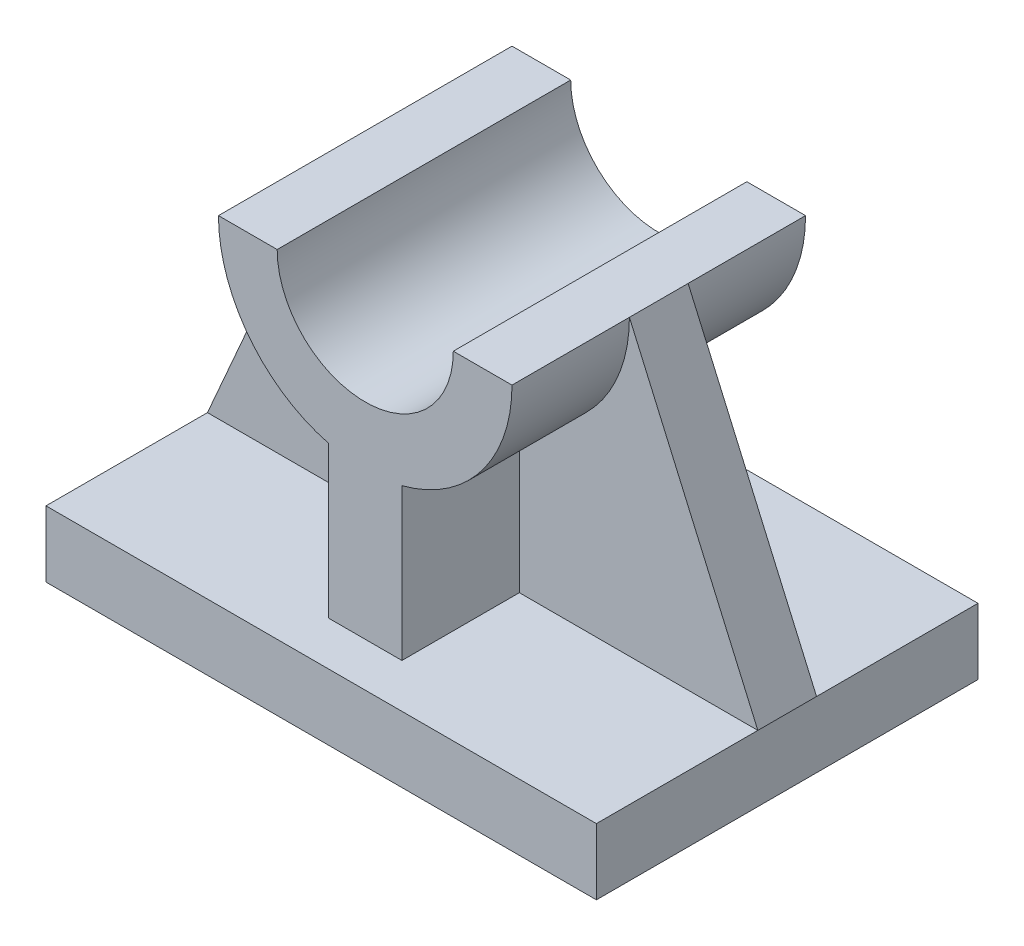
ISO-10303-21;
HEADER;
FILE_DESCRIPTION(('STEP AP214'),'2;1');
FILE_NAME('part.step','',(''),(''),'','','');
FILE_SCHEMA(('AUTOMOTIVE_DESIGN { 1 0 10303 214 1 1 1 1 }'));
ENDSEC;
DATA;
#1=APPLICATION_CONTEXT('core data for automotive mechanical design processes');
#2=APPLICATION_PROTOCOL_DEFINITION('international standard','automotive_design',2000,#1);
#3=PRODUCT_CONTEXT('',#1,'mechanical');
#4=PRODUCT('Part','Part','',(#3));
#5=PRODUCT_RELATED_PRODUCT_CATEGORY('part','',(#4));
#6=PRODUCT_DEFINITION_FORMATION('','',#4);
#7=PRODUCT_DEFINITION_CONTEXT('part definition',#1,'design');
#8=PRODUCT_DEFINITION('design','',#6,#7);
#9=PRODUCT_DEFINITION_SHAPE('','',#8);
#10=(LENGTH_UNIT() NAMED_UNIT(*) SI_UNIT(.MILLI.,.METRE.));
#11=(NAMED_UNIT(*) PLANE_ANGLE_UNIT() SI_UNIT($,.RADIAN.));
#12=(NAMED_UNIT(*) SI_UNIT($,.STERADIAN.) SOLID_ANGLE_UNIT());
#13=UNCERTAINTY_MEASURE_WITH_UNIT(LENGTH_MEASURE(1.E-05),#10,'distance_accuracy_value','');
#14=(GEOMETRIC_REPRESENTATION_CONTEXT(3) GLOBAL_UNCERTAINTY_ASSIGNED_CONTEXT((#13)) GLOBAL_UNIT_ASSIGNED_CONTEXT((#10,
#11,#12)) REPRESENTATION_CONTEXT('',''));
#15=CARTESIAN_POINT('',(0.,0.,0.));
#16=DIRECTION('',(0.,0.,1.));
#17=DIRECTION('',(1.,0.,0.));
#18=AXIS2_PLACEMENT_3D('',#15,#16,#17);
#19=CARTESIAN_POINT('',(0.,0.,26.));
#20=DIRECTION('',(0.,1.,0.));
#21=DIRECTION('',(-1.,0.,0.));
#22=AXIS2_PLACEMENT_3D('',#19,#20,#21);
#23=PLANE('',#22);
#24=DIRECTION('',(0.,0.,-1.));
#25=VECTOR('',#24,1.);
#26=CARTESIAN_POINT('',(-37.5,0.,26.));
#27=LINE('',#26,#25);
#28=CARTESIAN_POINT('',(-37.5,0.,-4.));
#29=VERTEX_POINT('',#28);
#30=CARTESIAN_POINT('',(-37.5,0.,-26.));
#31=VERTEX_POINT('',#30);
#32=EDGE_CURVE('E39',#29,#31,#27,.T.);
#33=ORIENTED_EDGE('',*,*,#32,.F.);
#34=DIRECTION('',(1.,0.,0.));
#35=VECTOR('',#34,1.);
#36=CARTESIAN_POINT('',(0.,0.,-4.));
#37=LINE('',#36,#35);
#38=CARTESIAN_POINT('',(-5.,0.,-4.));
#39=VERTEX_POINT('',#38);
#40=EDGE_CURVE('E287',#29,#39,#37,.T.);
#41=ORIENTED_EDGE('',*,*,#40,.T.);
#42=DIRECTION('',(0.,0.,-1.));
#43=VECTOR('',#42,1.);
#44=CARTESIAN_POINT('',(-5.,0.,20.));
#45=LINE('',#44,#43);
#46=CARTESIAN_POINT('',(-5.,0.,-20.));
#47=VERTEX_POINT('',#46);
#48=EDGE_CURVE('E358',#39,#47,#45,.T.);
#49=ORIENTED_EDGE('',*,*,#48,.T.);
#50=DIRECTION('',(1.,0.,0.));
#51=VECTOR('',#50,1.);
#52=CARTESIAN_POINT('',(0.,0.,-20.));
#53=LINE('',#52,#51);
#54=CARTESIAN_POINT('',(5.,0.,-20.));
#55=VERTEX_POINT('',#54);
#56=EDGE_CURVE('E317',#47,#55,#53,.T.);
#57=ORIENTED_EDGE('',*,*,#56,.T.);
#58=DIRECTION('',(0.,0.,-1.));
#59=VECTOR('',#58,1.);
#60=CARTESIAN_POINT('',(5.,0.,20.));
#61=LINE('',#60,#59);
#62=CARTESIAN_POINT('',(5.,0.,-4.));
#63=VERTEX_POINT('',#62);
#64=EDGE_CURVE('E333',#63,#55,#61,.T.);
#65=ORIENTED_EDGE('',*,*,#64,.F.);
#66=DIRECTION('',(1.,0.,0.));
#67=VECTOR('',#66,1.);
#68=CARTESIAN_POINT('',(0.,0.,-4.));
#69=LINE('',#68,#67);
#70=CARTESIAN_POINT('',(37.5,0.,-4.));
#71=VERTEX_POINT('',#70);
#72=EDGE_CURVE('E306',#63,#71,#69,.T.);
#73=ORIENTED_EDGE('',*,*,#72,.T.);
#74=DIRECTION('',(0.,0.,-1.));
#75=VECTOR('',#74,1.);
#76=CARTESIAN_POINT('',(37.5,0.,26.));
#77=LINE('',#76,#75);
#78=CARTESIAN_POINT('',(37.5,0.,-26.));
#79=VERTEX_POINT('',#78);
#80=EDGE_CURVE('E235',#71,#79,#77,.T.);
#81=ORIENTED_EDGE('',*,*,#80,.T.);
#82=DIRECTION('',(1.,0.,0.));
#83=VECTOR('',#82,1.);
#84=CARTESIAN_POINT('',(0.,0.,-26.));
#85=LINE('',#84,#83);
#86=EDGE_CURVE('E221',#31,#79,#85,.T.);
#87=ORIENTED_EDGE('',*,*,#86,.F.);
#88=EDGE_LOOP('',(#33,#41,#49,#57,#65,#73,#81,#87));
#89=FACE_BOUND('',#88,.T.);
#90=ADVANCED_FACE('F31',(#89),#23,.T.);
#91=CARTESIAN_POINT('',(0.,40.,20.));
#92=DIRECTION('',(0.,0.,-1.));
#93=DIRECTION('',(-1.,0.,0.));
#94=AXIS2_PLACEMENT_3D('',#91,#92,#93);
#95=CYLINDRICAL_SURFACE('',#94,20.);
#96=CARTESIAN_POINT('',(0.,40.,-4.));
#97=DIRECTION('',(0.,0.,1.));
#98=DIRECTION('',(1.,0.,0.));
#99=AXIS2_PLACEMENT_3D('',#96,#97,#98);
#100=CIRCLE('',#99,20.);
#101=CARTESIAN_POINT('',(-20.,40.,-4.));
#102=VERTEX_POINT('',#101);
#103=CARTESIAN_POINT('',(-5.00000000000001,20.6350832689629,-4.));
#104=VERTEX_POINT('',#103);
#105=EDGE_CURVE('E46',#102,#104,#100,.T.);
#106=ORIENTED_EDGE('',*,*,#105,.F.);
#107=DIRECTION('',(0.,0.,-1.));
#108=VECTOR('',#107,1.);
#109=CARTESIAN_POINT('',(-20.,40.,20.));
#110=LINE('',#109,#108);
#111=CARTESIAN_POINT('',(-20.,40.,-20.));
#112=VERTEX_POINT('',#111);
#113=EDGE_CURVE('E199',#102,#112,#110,.T.);
#114=ORIENTED_EDGE('',*,*,#113,.T.);
#115=CARTESIAN_POINT('',(0.,40.,-20.));
#116=DIRECTION('',(0.,0.,1.));
#117=DIRECTION('',(1.,0.,0.));
#118=AXIS2_PLACEMENT_3D('',#115,#116,#117);
#119=CIRCLE('',#118,20.);
#120=CARTESIAN_POINT('',(-5.00000000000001,20.6350832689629,-20.));
#121=VERTEX_POINT('',#120);
#122=EDGE_CURVE('E348',#112,#121,#119,.T.);
#123=ORIENTED_EDGE('',*,*,#122,.T.);
#124=DIRECTION('',(0.,0.,-1.));
#125=VECTOR('',#124,1.);
#126=CARTESIAN_POINT('',(-5.00000000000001,20.6350832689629,20.));
#127=LINE('',#126,#125);
#128=EDGE_CURVE('E359',#104,#121,#127,.T.);
#129=ORIENTED_EDGE('',*,*,#128,.F.);
#130=EDGE_LOOP('',(#106,#114,#123,#129));
#131=FACE_BOUND('',#130,.T.);
#132=ADVANCED_FACE('F373',(#131),#95,.T.);
#133=CARTESIAN_POINT('',(-4.99999999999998,-54.3244896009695,20.));
#134=DIRECTION('',(-1.,0.,0.));
#135=DIRECTION('',(0.,-1.,0.));
#136=AXIS2_PLACEMENT_3D('',#133,#134,#135);
#137=PLANE('',#136);
#138=ORIENTED_EDGE('',*,*,#48,.F.);
#139=DIRECTION('',(0.,1.,0.));
#140=VECTOR('',#139,1.);
#141=CARTESIAN_POINT('',(-4.99999999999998,-54.3244896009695,-4.));
#142=LINE('',#141,#140);
#143=EDGE_CURVE('E181',#39,#104,#142,.T.);
#144=ORIENTED_EDGE('',*,*,#143,.T.);
#145=ORIENTED_EDGE('',*,*,#128,.T.);
#146=DIRECTION('',(0.,1.,0.));
#147=VECTOR('',#146,1.);
#148=CARTESIAN_POINT('',(-4.99999999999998,-54.3244896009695,-20.));
#149=LINE('',#148,#147);
#150=EDGE_CURVE('E351',#47,#121,#149,.T.);
#151=ORIENTED_EDGE('',*,*,#150,.F.);
#152=EDGE_LOOP('',(#138,#144,#145,#151));
#153=FACE_BOUND('',#152,.T.);
#154=ADVANCED_FACE('F370',(#153),#137,.T.);
#155=CARTESIAN_POINT('',(5.,-54.3244896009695,20.));
#156=DIRECTION('',(-1.,0.,0.));
#157=DIRECTION('',(0.,-1.,0.));
#158=AXIS2_PLACEMENT_3D('',#155,#156,#157);
#159=PLANE('',#158);
#160=DIRECTION('',(0.,1.,0.));
#161=VECTOR('',#160,1.);
#162=CARTESIAN_POINT('',(5.,-54.3244896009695,-4.));
#163=LINE('',#162,#161);
#164=CARTESIAN_POINT('',(5.,20.6350832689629,-4.));
#165=VERTEX_POINT('',#164);
#166=EDGE_CURVE('E304',#63,#165,#163,.T.);
#167=ORIENTED_EDGE('',*,*,#166,.F.);
#168=ORIENTED_EDGE('',*,*,#64,.T.);
#169=DIRECTION('',(0.,1.,0.));
#170=VECTOR('',#169,1.);
#171=CARTESIAN_POINT('',(5.,-54.3244896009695,-20.));
#172=LINE('',#171,#170);
#173=CARTESIAN_POINT('',(5.,20.6350832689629,-20.));
#174=VERTEX_POINT('',#173);
#175=EDGE_CURVE('E312',#55,#174,#172,.T.);
#176=ORIENTED_EDGE('',*,*,#175,.T.);
#177=DIRECTION('',(0.,0.,-1.));
#178=VECTOR('',#177,1.);
#179=CARTESIAN_POINT('',(5.,20.6350832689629,20.));
#180=LINE('',#179,#178);
#181=EDGE_CURVE('E217',#165,#174,#180,.T.);
#182=ORIENTED_EDGE('',*,*,#181,.F.);
#183=EDGE_LOOP('',(#167,#168,#176,#182));
#184=FACE_BOUND('',#183,.T.);
#185=ADVANCED_FACE('F389',(#184),#159,.F.);
#186=CARTESIAN_POINT('',(0.,40.,20.));
#187=DIRECTION('',(0.,0.,-1.));
#188=DIRECTION('',(-1.,0.,0.));
#189=AXIS2_PLACEMENT_3D('',#186,#187,#188);
#190=CYLINDRICAL_SURFACE('',#189,20.);
#191=CARTESIAN_POINT('',(0.,40.,-4.));
#192=DIRECTION('',(0.,0.,1.));
#193=DIRECTION('',(1.,0.,0.));
#194=AXIS2_PLACEMENT_3D('',#191,#192,#193);
#195=CIRCLE('',#194,20.);
#196=CARTESIAN_POINT('',(20.,40.,-4.));
#197=VERTEX_POINT('',#196);
#198=EDGE_CURVE('E54',#165,#197,#195,.T.);
#199=ORIENTED_EDGE('',*,*,#198,.F.);
#200=ORIENTED_EDGE('',*,*,#181,.T.);
#201=CARTESIAN_POINT('',(0.,40.,-20.));
#202=DIRECTION('',(0.,0.,1.));
#203=DIRECTION('',(1.,0.,0.));
#204=AXIS2_PLACEMENT_3D('',#201,#202,#203);
#205=CIRCLE('',#204,20.);
#206=CARTESIAN_POINT('',(20.,40.,-20.));
#207=VERTEX_POINT('',#206);
#208=EDGE_CURVE('E336',#174,#207,#205,.T.);
#209=ORIENTED_EDGE('',*,*,#208,.T.);
#210=DIRECTION('',(0.,0.,-1.));
#211=VECTOR('',#210,1.);
#212=CARTESIAN_POINT('',(20.,40.,20.));
#213=LINE('',#212,#211);
#214=EDGE_CURVE('E213',#197,#207,#213,.T.);
#215=ORIENTED_EDGE('',*,*,#214,.F.);
#216=EDGE_LOOP('',(#199,#200,#209,#215));
#217=FACE_BOUND('',#216,.T.);
#218=ADVANCED_FACE('F385',(#217),#190,.T.);
#219=DIRECTION('',(1.,0.,0.));
#220=VECTOR('',#219,1.);
#221=CARTESIAN_POINT('',(0.,0.,4.));
#222=LINE('',#221,#220);
#223=CARTESIAN_POINT('',(-37.5,0.,4.));
#224=VERTEX_POINT('',#223);
#225=CARTESIAN_POINT('',(-5.,0.,4.));
#226=VERTEX_POINT('',#225);
#227=EDGE_CURVE('E190',#224,#226,#222,.T.);
#228=ORIENTED_EDGE('',*,*,#227,.F.);
#229=CARTESIAN_POINT('',(-37.5,0.,26.));
#230=VERTEX_POINT('',#229);
#231=EDGE_CURVE('E11',#230,#224,#27,.T.);
#232=ORIENTED_EDGE('',*,*,#231,.F.);
#233=DIRECTION('',(1.,0.,0.));
#234=VECTOR('',#233,1.);
#235=CARTESIAN_POINT('',(0.,0.,26.));
#236=LINE('',#235,#234);
#237=CARTESIAN_POINT('',(37.5,0.,26.));
#238=VERTEX_POINT('',#237);
#239=EDGE_CURVE('E222',#230,#238,#236,.T.);
#240=ORIENTED_EDGE('',*,*,#239,.T.);
#241=CARTESIAN_POINT('',(37.5,0.,4.));
#242=VERTEX_POINT('',#241);
#243=EDGE_CURVE('E246',#238,#242,#77,.T.);
#244=ORIENTED_EDGE('',*,*,#243,.T.);
#245=DIRECTION('',(1.,0.,0.));
#246=VECTOR('',#245,1.);
#247=CARTESIAN_POINT('',(0.,0.,4.));
#248=LINE('',#247,#246);
#249=CARTESIAN_POINT('',(5.,0.,4.));
#250=VERTEX_POINT('',#249);
#251=EDGE_CURVE('E298',#250,#242,#248,.T.);
#252=ORIENTED_EDGE('',*,*,#251,.F.);
#253=CARTESIAN_POINT('',(5.,0.,20.));
#254=VERTEX_POINT('',#253);
#255=EDGE_CURVE('E356',#254,#250,#61,.T.);
#256=ORIENTED_EDGE('',*,*,#255,.F.);
#257=DIRECTION('',(1.,0.,0.));
#258=VECTOR('',#257,1.);
#259=CARTESIAN_POINT('',(0.,0.,20.));
#260=LINE('',#259,#258);
#261=CARTESIAN_POINT('',(-5.,0.,20.));
#262=VERTEX_POINT('',#261);
#263=EDGE_CURVE('E331',#262,#254,#260,.T.);
#264=ORIENTED_EDGE('',*,*,#263,.F.);
#265=EDGE_CURVE('E280',#262,#226,#45,.T.);
#266=ORIENTED_EDGE('',*,*,#265,.T.);
#267=EDGE_LOOP('',(#228,#232,#240,#244,#252,#256,#264,#266));
#268=FACE_BOUND('',#267,.T.);
#269=ADVANCED_FACE('F33',(#268),#23,.T.);
#270=CARTESIAN_POINT('',(-37.5,-54.3244896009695,26.));
#271=DIRECTION('',(-1.,0.,0.));
#272=DIRECTION('',(0.,0.,1.));
#273=AXIS2_PLACEMENT_3D('',#270,#271,#272);
#274=PLANE('',#273);
#275=DIRECTION('',(0.,1.,0.));
#276=VECTOR('',#275,1.);
#277=CARTESIAN_POINT('',(-37.5,-54.3244896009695,-26.));
#278=LINE('',#277,#276);
#279=CARTESIAN_POINT('',(-37.5,-8.99999999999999,-26.));
#280=VERTEX_POINT('',#279);
#281=EDGE_CURVE('E238',#280,#31,#278,.T.);
#282=ORIENTED_EDGE('',*,*,#281,.F.);
#283=DIRECTION('',(0.,0.,-1.));
#284=VECTOR('',#283,1.);
#285=CARTESIAN_POINT('',(-37.5,-8.99999999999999,26.));
#286=LINE('',#285,#284);
#287=CARTESIAN_POINT('',(-37.5,-8.99999999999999,26.));
#288=VERTEX_POINT('',#287);
#289=EDGE_CURVE('E250',#288,#280,#286,.T.);
#290=ORIENTED_EDGE('',*,*,#289,.F.);
#291=DIRECTION('',(0.,1.,0.));
#292=VECTOR('',#291,1.);
#293=CARTESIAN_POINT('',(-37.5,-54.3244896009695,26.));
#294=LINE('',#293,#292);
#295=EDGE_CURVE('E225',#288,#230,#294,.T.);
#296=ORIENTED_EDGE('',*,*,#295,.T.);
#297=ORIENTED_EDGE('',*,*,#231,.T.);
#298=DIRECTION('',(0.,0.,-1.));
#299=VECTOR('',#298,1.);
#300=CARTESIAN_POINT('',(-37.5,0.,4.));
#301=LINE('',#300,#299);
#302=EDGE_CURVE('E189',#224,#29,#301,.T.);
#303=ORIENTED_EDGE('',*,*,#302,.T.);
#304=ORIENTED_EDGE('',*,*,#32,.T.);
#305=EDGE_LOOP('',(#282,#290,#296,#297,#303,#304));
#306=FACE_BOUND('',#305,.T.);
#307=ADVANCED_FACE('F257',(#306),#274,.T.);
#308=CARTESIAN_POINT('',(0.,-8.99999999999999,26.));
#309=DIRECTION('',(0.,-1.,0.));
#310=DIRECTION('',(1.,0.,0.));
#311=AXIS2_PLACEMENT_3D('',#308,#309,#310);
#312=PLANE('',#311);
#313=DIRECTION('',(-1.,0.,0.));
#314=VECTOR('',#313,1.);
#315=CARTESIAN_POINT('',(0.,-8.99999999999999,-26.));
#316=LINE('',#315,#314);
#317=CARTESIAN_POINT('',(37.5,-8.99999999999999,-26.));
#318=VERTEX_POINT('',#317);
#319=EDGE_CURVE('E241',#318,#280,#316,.T.);
#320=ORIENTED_EDGE('',*,*,#319,.F.);
#321=DIRECTION('',(0.,0.,-1.));
#322=VECTOR('',#321,1.);
#323=CARTESIAN_POINT('',(37.5,-8.99999999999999,26.));
#324=LINE('',#323,#322);
#325=CARTESIAN_POINT('',(37.5,-8.99999999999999,26.));
#326=VERTEX_POINT('',#325);
#327=EDGE_CURVE('E249',#326,#318,#324,.T.);
#328=ORIENTED_EDGE('',*,*,#327,.F.);
#329=DIRECTION('',(-1.,0.,0.));
#330=VECTOR('',#329,1.);
#331=CARTESIAN_POINT('',(0.,-8.99999999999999,26.));
#332=LINE('',#331,#330);
#333=EDGE_CURVE('E229',#326,#288,#332,.T.);
#334=ORIENTED_EDGE('',*,*,#333,.T.);
#335=ORIENTED_EDGE('',*,*,#289,.T.);
#336=EDGE_LOOP('',(#320,#328,#334,#335));
#337=FACE_BOUND('',#336,.T.);
#338=ADVANCED_FACE('F265',(#337),#312,.T.);
#339=CARTESIAN_POINT('',(37.5,-54.3244896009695,26.));
#340=DIRECTION('',(1.,0.,0.));
#341=DIRECTION('',(0.,0.,-1.));
#342=AXIS2_PLACEMENT_3D('',#339,#340,#341);
#343=PLANE('',#342);
#344=DIRECTION('',(0.,-1.,0.));
#345=VECTOR('',#344,1.);
#346=CARTESIAN_POINT('',(37.5,-54.3244896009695,-26.));
#347=LINE('',#346,#345);
#348=EDGE_CURVE('E226',#79,#318,#347,.T.);
#349=ORIENTED_EDGE('',*,*,#348,.F.);
#350=ORIENTED_EDGE('',*,*,#80,.F.);
#351=DIRECTION('',(0.,0.,-1.));
#352=VECTOR('',#351,1.);
#353=CARTESIAN_POINT('',(37.5,0.,4.));
#354=LINE('',#353,#352);
#355=EDGE_CURVE('E275',#242,#71,#354,.T.);
#356=ORIENTED_EDGE('',*,*,#355,.F.);
#357=ORIENTED_EDGE('',*,*,#243,.F.);
#358=DIRECTION('',(0.,-1.,0.));
#359=VECTOR('',#358,1.);
#360=CARTESIAN_POINT('',(37.5,-54.3244896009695,26.));
#361=LINE('',#360,#359);
#362=EDGE_CURVE('E232',#238,#326,#361,.T.);
#363=ORIENTED_EDGE('',*,*,#362,.T.);
#364=ORIENTED_EDGE('',*,*,#327,.T.);
#365=EDGE_LOOP('',(#349,#350,#356,#357,#363,#364));
#366=FACE_BOUND('',#365,.T.);
#367=ADVANCED_FACE('F273',(#366),#343,.T.);
#368=CARTESIAN_POINT('',(0.,-54.3244896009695,26.));
#369=DIRECTION('',(0.,0.,1.));
#370=DIRECTION('',(1.,0.,0.));
#371=AXIS2_PLACEMENT_3D('',#368,#369,#370);
#372=PLANE('',#371);
#373=ORIENTED_EDGE('',*,*,#239,.F.);
#374=ORIENTED_EDGE('',*,*,#295,.F.);
#375=ORIENTED_EDGE('',*,*,#333,.F.);
#376=ORIENTED_EDGE('',*,*,#362,.F.);
#377=EDGE_LOOP('',(#373,#374,#375,#376));
#378=FACE_BOUND('',#377,.T.);
#379=ADVANCED_FACE('F272',(#378),#372,.T.);
#380=CARTESIAN_POINT('',(0.,-54.3244896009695,-26.));
#381=DIRECTION('',(0.,0.,1.));
#382=DIRECTION('',(1.,0.,0.));
#383=AXIS2_PLACEMENT_3D('',#380,#381,#382);
#384=PLANE('',#383);
#385=ORIENTED_EDGE('',*,*,#86,.T.);
#386=ORIENTED_EDGE('',*,*,#348,.T.);
#387=ORIENTED_EDGE('',*,*,#319,.T.);
#388=ORIENTED_EDGE('',*,*,#281,.T.);
#389=EDGE_LOOP('',(#385,#386,#387,#388));
#390=FACE_BOUND('',#389,.T.);
#391=ADVANCED_FACE('F264',(#390),#384,.F.);
#392=ORIENTED_EDGE('',*,*,#255,.T.);
#393=DIRECTION('',(0.,1.,0.));
#394=VECTOR('',#393,1.);
#395=CARTESIAN_POINT('',(5.,-54.3244896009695,4.));
#396=LINE('',#395,#394);
#397=CARTESIAN_POINT('',(5.,20.6350832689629,4.));
#398=VERTEX_POINT('',#397);
#399=EDGE_CURVE('E294',#250,#398,#396,.T.);
#400=ORIENTED_EDGE('',*,*,#399,.T.);
#401=CARTESIAN_POINT('',(5.,20.6350832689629,20.));
#402=VERTEX_POINT('',#401);
#403=EDGE_CURVE('E218',#402,#398,#180,.T.);
#404=ORIENTED_EDGE('',*,*,#403,.F.);
#405=DIRECTION('',(0.,1.,0.));
#406=VECTOR('',#405,1.);
#407=CARTESIAN_POINT('',(5.,-54.3244896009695,20.));
#408=LINE('',#407,#406);
#409=EDGE_CURVE('E313',#254,#402,#408,.T.);
#410=ORIENTED_EDGE('',*,*,#409,.F.);
#411=EDGE_LOOP('',(#392,#400,#404,#410));
#412=FACE_BOUND('',#411,.T.);
#413=ADVANCED_FACE('F399',(#412),#159,.F.);
#414=ORIENTED_EDGE('',*,*,#403,.T.);
#415=CARTESIAN_POINT('',(0.,40.,4.));
#416=DIRECTION('',(0.,0.,1.));
#417=DIRECTION('',(1.,0.,0.));
#418=AXIS2_PLACEMENT_3D('',#415,#416,#417);
#419=CIRCLE('',#418,20.);
#420=CARTESIAN_POINT('',(20.,40.,4.));
#421=VERTEX_POINT('',#420);
#422=EDGE_CURVE('E291',#398,#421,#419,.T.);
#423=ORIENTED_EDGE('',*,*,#422,.T.);
#424=CARTESIAN_POINT('',(20.,40.,20.));
#425=VERTEX_POINT('',#424);
#426=EDGE_CURVE('E214',#425,#421,#213,.T.);
#427=ORIENTED_EDGE('',*,*,#426,.F.);
#428=CARTESIAN_POINT('',(0.,40.,20.));
#429=DIRECTION('',(0.,0.,1.));
#430=DIRECTION('',(1.,0.,0.));
#431=AXIS2_PLACEMENT_3D('',#428,#429,#430);
#432=CIRCLE('',#431,20.);
#433=EDGE_CURVE('E316',#402,#425,#432,.T.);
#434=ORIENTED_EDGE('',*,*,#433,.F.);
#435=EDGE_LOOP('',(#414,#423,#427,#434));
#436=FACE_BOUND('',#435,.T.);
#437=ADVANCED_FACE('F427',(#436),#190,.T.);
#438=CARTESIAN_POINT('',(0.,40.,20.));
#439=DIRECTION('',(0.,1.,0.));
#440=DIRECTION('',(0.,0.,1.));
#441=AXIS2_PLACEMENT_3D('',#438,#439,#440);
#442=PLANE('',#441);
#443=DIRECTION('',(1.,0.,0.));
#444=VECTOR('',#443,1.);
#445=CARTESIAN_POINT('',(0.,40.,-20.));
#446=LINE('',#445,#444);
#447=CARTESIAN_POINT('',(12.,40.,-20.));
#448=VERTEX_POINT('',#447);
#449=EDGE_CURVE('E339',#448,#207,#446,.T.);
#450=ORIENTED_EDGE('',*,*,#449,.F.);
#451=DIRECTION('',(0.,0.,-1.));
#452=VECTOR('',#451,1.);
#453=CARTESIAN_POINT('',(12.,40.,20.));
#454=LINE('',#453,#452);
#455=CARTESIAN_POINT('',(12.,40.,20.));
#456=VERTEX_POINT('',#455);
#457=EDGE_CURVE('E206',#456,#448,#454,.T.);
#458=ORIENTED_EDGE('',*,*,#457,.F.);
#459=DIRECTION('',(1.,0.,0.));
#460=VECTOR('',#459,1.);
#461=CARTESIAN_POINT('',(0.,40.,20.));
#462=LINE('',#461,#460);
#463=EDGE_CURVE('E319',#456,#425,#462,.T.);
#464=ORIENTED_EDGE('',*,*,#463,.T.);
#465=ORIENTED_EDGE('',*,*,#426,.T.);
#466=DIRECTION('',(0.,0.,-1.));
#467=VECTOR('',#466,1.);
#468=CARTESIAN_POINT('',(20.,40.,4.));
#469=LINE('',#468,#467);
#470=EDGE_CURVE('E302',#421,#197,#469,.T.);
#471=ORIENTED_EDGE('',*,*,#470,.T.);
#472=ORIENTED_EDGE('',*,*,#214,.T.);
#473=EDGE_LOOP('',(#450,#458,#464,#465,#471,#472));
#474=FACE_BOUND('',#473,.T.);
#475=ADVANCED_FACE('F380',(#474),#442,.T.);
#476=CARTESIAN_POINT('',(0.,40.,20.));
#477=DIRECTION('',(0.,0.,-1.));
#478=DIRECTION('',(-1.,0.,0.));
#479=AXIS2_PLACEMENT_3D('',#476,#477,#478);
#480=CYLINDRICAL_SURFACE('',#479,12.);
#481=CARTESIAN_POINT('',(0.,40.,-20.));
#482=DIRECTION('',(0.,0.,1.));
#483=DIRECTION('',(1.,0.,0.));
#484=AXIS2_PLACEMENT_3D('',#481,#482,#483);
#485=CIRCLE('',#484,12.);
#486=CARTESIAN_POINT('',(-12.,40.,-20.));
#487=VERTEX_POINT('',#486);
#488=EDGE_CURVE('E342',#487,#448,#485,.T.);
#489=ORIENTED_EDGE('',*,*,#488,.F.);
#490=DIRECTION('',(0.,0.,-1.));
#491=VECTOR('',#490,1.);
#492=CARTESIAN_POINT('',(-12.,40.,20.));
#493=LINE('',#492,#491);
#494=CARTESIAN_POINT('',(-12.,40.,20.));
#495=VERTEX_POINT('',#494);
#496=EDGE_CURVE('E204',#495,#487,#493,.T.);
#497=ORIENTED_EDGE('',*,*,#496,.F.);
#498=CARTESIAN_POINT('',(0.,40.,20.));
#499=DIRECTION('',(0.,0.,1.));
#500=DIRECTION('',(1.,0.,0.));
#501=AXIS2_PLACEMENT_3D('',#498,#499,#500);
#502=CIRCLE('',#501,12.);
#503=EDGE_CURVE('E322',#495,#456,#502,.T.);
#504=ORIENTED_EDGE('',*,*,#503,.T.);
#505=ORIENTED_EDGE('',*,*,#457,.T.);
#506=EDGE_LOOP('',(#489,#497,#504,#505));
#507=FACE_BOUND('',#506,.T.);
#508=ADVANCED_FACE('F377',(#507),#480,.F.);
#509=CARTESIAN_POINT('',(0.,40.,20.));
#510=DIRECTION('',(0.,1.,0.));
#511=DIRECTION('',(0.,0.,1.));
#512=AXIS2_PLACEMENT_3D('',#509,#510,#511);
#513=PLANE('',#512);
#514=DIRECTION('',(1.,0.,0.));
#515=VECTOR('',#514,1.);
#516=CARTESIAN_POINT('',(0.,40.,-20.));
#517=LINE('',#516,#515);
#518=EDGE_CURVE('E345',#112,#487,#517,.T.);
#519=ORIENTED_EDGE('',*,*,#518,.F.);
#520=ORIENTED_EDGE('',*,*,#113,.F.);
#521=DIRECTION('',(0.,0.,-1.));
#522=VECTOR('',#521,1.);
#523=CARTESIAN_POINT('',(-20.,40.,4.));
#524=LINE('',#523,#522);
#525=CARTESIAN_POINT('',(-20.,40.,4.));
#526=VERTEX_POINT('',#525);
#527=EDGE_CURVE('E187',#526,#102,#524,.T.);
#528=ORIENTED_EDGE('',*,*,#527,.F.);
#529=CARTESIAN_POINT('',(-20.,40.,20.));
#530=VERTEX_POINT('',#529);
#531=EDGE_CURVE('E197',#530,#526,#110,.T.);
#532=ORIENTED_EDGE('',*,*,#531,.F.);
#533=DIRECTION('',(1.,0.,0.));
#534=VECTOR('',#533,1.);
#535=CARTESIAN_POINT('',(0.,40.,20.));
#536=LINE('',#535,#534);
#537=EDGE_CURVE('E325',#530,#495,#536,.T.);
#538=ORIENTED_EDGE('',*,*,#537,.T.);
#539=ORIENTED_EDGE('',*,*,#496,.T.);
#540=EDGE_LOOP('',(#519,#520,#528,#532,#538,#539));
#541=FACE_BOUND('',#540,.T.);
#542=ADVANCED_FACE('F195',(#541),#513,.T.);
#543=ORIENTED_EDGE('',*,*,#531,.T.);
#544=CARTESIAN_POINT('',(0.,40.,4.));
#545=DIRECTION('',(0.,0.,1.));
#546=DIRECTION('',(1.,0.,0.));
#547=AXIS2_PLACEMENT_3D('',#544,#545,#546);
#548=CIRCLE('',#547,20.);
#549=CARTESIAN_POINT('',(-5.00000000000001,20.6350832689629,4.));
#550=VERTEX_POINT('',#549);
#551=EDGE_CURVE('E170',#526,#550,#548,.T.);
#552=ORIENTED_EDGE('',*,*,#551,.T.);
#553=CARTESIAN_POINT('',(-5.00000000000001,20.6350832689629,20.));
#554=VERTEX_POINT('',#553);
#555=EDGE_CURVE('E208',#554,#550,#127,.T.);
#556=ORIENTED_EDGE('',*,*,#555,.F.);
#557=CARTESIAN_POINT('',(0.,40.,20.));
#558=DIRECTION('',(0.,0.,1.));
#559=DIRECTION('',(1.,0.,0.));
#560=AXIS2_PLACEMENT_3D('',#557,#558,#559);
#561=CIRCLE('',#560,20.);
#562=EDGE_CURVE('E202',#530,#554,#561,.T.);
#563=ORIENTED_EDGE('',*,*,#562,.F.);
#564=EDGE_LOOP('',(#543,#552,#556,#563));
#565=FACE_BOUND('',#564,.T.);
#566=ADVANCED_FACE('F201',(#565),#95,.T.);
#567=DIRECTION('',(0.,1.,0.));
#568=VECTOR('',#567,1.);
#569=CARTESIAN_POINT('',(-4.99999999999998,-54.3244896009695,4.));
#570=LINE('',#569,#568);
#571=EDGE_CURVE('E176',#226,#550,#570,.T.);
#572=ORIENTED_EDGE('',*,*,#571,.F.);
#573=ORIENTED_EDGE('',*,*,#265,.F.);
#574=DIRECTION('',(0.,1.,0.));
#575=VECTOR('',#574,1.);
#576=CARTESIAN_POINT('',(-4.99999999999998,-54.3244896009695,20.));
#577=LINE('',#576,#575);
#578=EDGE_CURVE('E328',#262,#554,#577,.T.);
#579=ORIENTED_EDGE('',*,*,#578,.T.);
#580=ORIENTED_EDGE('',*,*,#555,.T.);
#581=EDGE_LOOP('',(#572,#573,#579,#580));
#582=FACE_BOUND('',#581,.T.);
#583=ADVANCED_FACE('F406',(#582),#137,.T.);
#584=CARTESIAN_POINT('',(0.,-54.3244896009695,20.));
#585=DIRECTION('',(0.,0.,1.));
#586=DIRECTION('',(1.,0.,0.));
#587=AXIS2_PLACEMENT_3D('',#584,#585,#586);
#588=PLANE('',#587);
#589=ORIENTED_EDGE('',*,*,#409,.T.);
#590=ORIENTED_EDGE('',*,*,#433,.T.);
#591=ORIENTED_EDGE('',*,*,#463,.F.);
#592=ORIENTED_EDGE('',*,*,#503,.F.);
#593=ORIENTED_EDGE('',*,*,#537,.F.);
#594=ORIENTED_EDGE('',*,*,#562,.T.);
#595=ORIENTED_EDGE('',*,*,#578,.F.);
#596=ORIENTED_EDGE('',*,*,#263,.T.);
#597=EDGE_LOOP('',(#589,#590,#591,#592,#593,#594,#595,#596));
#598=FACE_BOUND('',#597,.T.);
#599=ADVANCED_FACE('F402',(#598),#588,.T.);
#600=CARTESIAN_POINT('',(0.,-54.3244896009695,-20.));
#601=DIRECTION('',(0.,0.,1.));
#602=DIRECTION('',(1.,0.,0.));
#603=AXIS2_PLACEMENT_3D('',#600,#601,#602);
#604=PLANE('',#603);
#605=ORIENTED_EDGE('',*,*,#175,.F.);
#606=ORIENTED_EDGE('',*,*,#56,.F.);
#607=ORIENTED_EDGE('',*,*,#150,.T.);
#608=ORIENTED_EDGE('',*,*,#122,.F.);
#609=ORIENTED_EDGE('',*,*,#518,.T.);
#610=ORIENTED_EDGE('',*,*,#488,.T.);
#611=ORIENTED_EDGE('',*,*,#449,.T.);
#612=ORIENTED_EDGE('',*,*,#208,.F.);
#613=EDGE_LOOP('',(#605,#606,#607,#608,#609,#610,#611,#612));
#614=FACE_BOUND('',#613,.T.);
#615=ADVANCED_FACE('F367',(#614),#604,.F.);
#616=CARTESIAN_POINT('',(51.4240748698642,-31.8264568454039,4.));
#617=DIRECTION('',(-0.916157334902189,-0.400818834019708,0.));
#618=DIRECTION('',(0.400818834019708,-0.916157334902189,0.));
#619=AXIS2_PLACEMENT_3D('',#616,#617,#618);
#620=PLANE('',#619);
#621=DIRECTION('',(-0.400818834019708,0.916157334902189,0.));
#622=VECTOR('',#621,1.);
#623=CARTESIAN_POINT('',(51.4240748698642,-31.8264568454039,-4.));
#624=LINE('',#623,#622);
#625=EDGE_CURVE('E295',#71,#197,#624,.T.);
#626=ORIENTED_EDGE('',*,*,#625,.T.);
#627=ORIENTED_EDGE('',*,*,#470,.F.);
#628=DIRECTION('',(-0.400818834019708,0.916157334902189,0.));
#629=VECTOR('',#628,1.);
#630=CARTESIAN_POINT('',(51.4240748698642,-31.8264568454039,4.));
#631=LINE('',#630,#629);
#632=EDGE_CURVE('E300',#242,#421,#631,.T.);
#633=ORIENTED_EDGE('',*,*,#632,.F.);
#634=ORIENTED_EDGE('',*,*,#355,.T.);
#635=EDGE_LOOP('',(#626,#627,#633,#634));
#636=FACE_BOUND('',#635,.T.);
#637=ADVANCED_FACE('F392',(#636),#620,.F.);
#638=CARTESIAN_POINT('',(0.,-54.3244896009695,4.));
#639=DIRECTION('',(0.,0.,1.));
#640=DIRECTION('',(1.,0.,0.));
#641=AXIS2_PLACEMENT_3D('',#638,#639,#640);
#642=PLANE('',#641);
#643=ORIENTED_EDGE('',*,*,#422,.F.);
#644=ORIENTED_EDGE('',*,*,#399,.F.);
#645=ORIENTED_EDGE('',*,*,#251,.T.);
#646=ORIENTED_EDGE('',*,*,#632,.T.);
#647=EDGE_LOOP('',(#643,#644,#645,#646));
#648=FACE_BOUND('',#647,.T.);
#649=ADVANCED_FACE('F395',(#648),#642,.T.);
#650=CARTESIAN_POINT('',(0.,-54.3244896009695,-4.));
#651=DIRECTION('',(0.,0.,1.));
#652=DIRECTION('',(1.,0.,0.));
#653=AXIS2_PLACEMENT_3D('',#650,#651,#652);
#654=PLANE('',#653);
#655=ORIENTED_EDGE('',*,*,#198,.T.);
#656=ORIENTED_EDGE('',*,*,#625,.F.);
#657=ORIENTED_EDGE('',*,*,#72,.F.);
#658=ORIENTED_EDGE('',*,*,#166,.T.);
#659=EDGE_LOOP('',(#655,#656,#657,#658));
#660=FACE_BOUND('',#659,.T.);
#661=ADVANCED_FACE('F390',(#660),#654,.F.);
#662=CARTESIAN_POINT('',(-51.4240748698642,-31.8264568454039,4.));
#663=DIRECTION('',(-0.916157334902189,0.400818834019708,0.));
#664=DIRECTION('',(-0.400818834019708,-0.916157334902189,0.));
#665=AXIS2_PLACEMENT_3D('',#662,#663,#664);
#666=PLANE('',#665);
#667=DIRECTION('',(0.400818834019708,0.916157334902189,0.));
#668=VECTOR('',#667,1.);
#669=CARTESIAN_POINT('',(-51.4240748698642,-31.8264568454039,-4.));
#670=LINE('',#669,#668);
#671=EDGE_CURVE('E285',#29,#102,#670,.T.);
#672=ORIENTED_EDGE('',*,*,#671,.F.);
#673=ORIENTED_EDGE('',*,*,#302,.F.);
#674=DIRECTION('',(0.400818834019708,0.916157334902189,0.));
#675=VECTOR('',#674,1.);
#676=CARTESIAN_POINT('',(-51.4240748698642,-31.8264568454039,4.));
#677=LINE('',#676,#675);
#678=EDGE_CURVE('E173',#224,#526,#677,.T.);
#679=ORIENTED_EDGE('',*,*,#678,.T.);
#680=ORIENTED_EDGE('',*,*,#527,.T.);
#681=EDGE_LOOP('',(#672,#673,#679,#680));
#682=FACE_BOUND('',#681,.T.);
#683=ADVANCED_FACE('F186',(#682),#666,.T.);
#684=CARTESIAN_POINT('',(0.,-54.3244896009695,4.));
#685=DIRECTION('',(0.,0.,1.));
#686=DIRECTION('',(1.,0.,0.));
#687=AXIS2_PLACEMENT_3D('',#684,#685,#686);
#688=PLANE('',#687);
#689=ORIENTED_EDGE('',*,*,#551,.F.);
#690=ORIENTED_EDGE('',*,*,#678,.F.);
#691=ORIENTED_EDGE('',*,*,#227,.T.);
#692=ORIENTED_EDGE('',*,*,#571,.T.);
#693=EDGE_LOOP('',(#689,#690,#691,#692));
#694=FACE_BOUND('',#693,.T.);
#695=ADVANCED_FACE('F172',(#694),#688,.T.);
#696=CARTESIAN_POINT('',(0.,-54.3244896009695,-4.));
#697=DIRECTION('',(0.,0.,1.));
#698=DIRECTION('',(1.,0.,0.));
#699=AXIS2_PLACEMENT_3D('',#696,#697,#698);
#700=PLANE('',#699);
#701=ORIENTED_EDGE('',*,*,#105,.T.);
#702=ORIENTED_EDGE('',*,*,#143,.F.);
#703=ORIENTED_EDGE('',*,*,#40,.F.);
#704=ORIENTED_EDGE('',*,*,#671,.T.);
#705=EDGE_LOOP('',(#701,#702,#703,#704));
#706=FACE_BOUND('',#705,.T.);
#707=ADVANCED_FACE('F581',(#706),#700,.F.);
#708=CLOSED_SHELL('',(#90,#132,#154,#185,#218,#269,#307,#338,#367,#379,#391,#413,#437,#475,#508,
#542,#566,#583,#599,#615,#637,#649,#661,#683,#695,#707));
#709=MANIFOLD_SOLID_BREP('B2',#708);
#710=ADVANCED_BREP_SHAPE_REPRESENTATION('',(#18,#709),#14);
#711=SHAPE_DEFINITION_REPRESENTATION(#9,#710);
ENDSEC;
END-ISO-10303-21;
